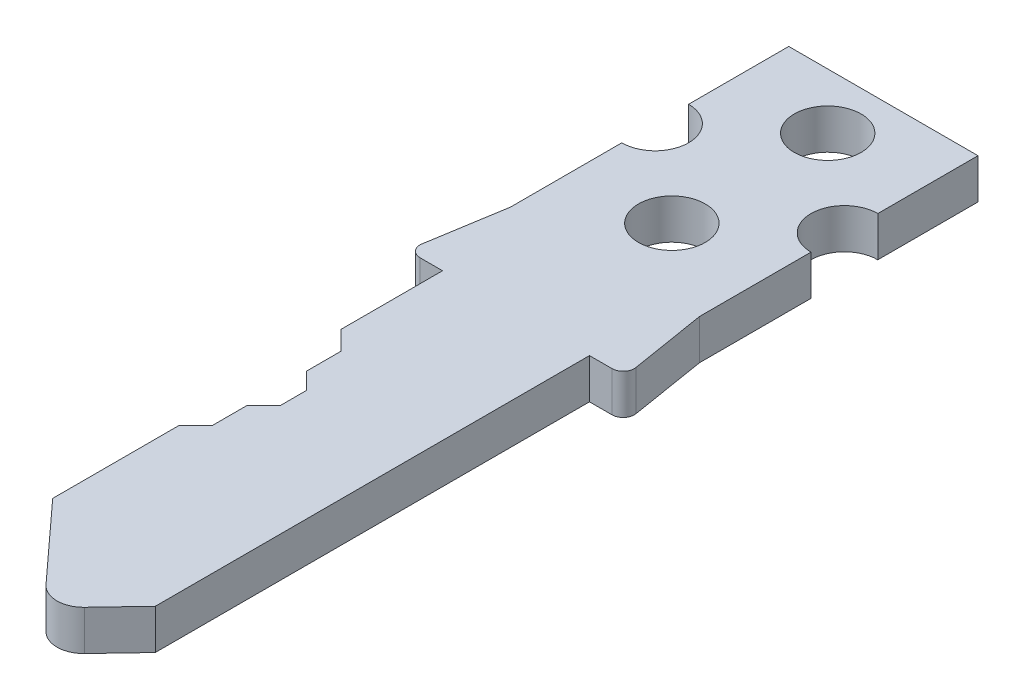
ISO-10303-21;
HEADER;
FILE_DESCRIPTION(('STEP AP214'),'2;1');
FILE_NAME('part.step','',(''),(''),'','','');
FILE_SCHEMA(('AUTOMOTIVE_DESIGN { 1 0 10303 214 1 1 1 1 }'));
ENDSEC;
DATA;
#1=APPLICATION_CONTEXT('core data for automotive mechanical design processes');
#2=APPLICATION_PROTOCOL_DEFINITION('international standard','automotive_design',2000,#1);
#3=PRODUCT_CONTEXT('',#1,'mechanical');
#4=PRODUCT('Part','Part','',(#3));
#5=PRODUCT_RELATED_PRODUCT_CATEGORY('part','',(#4));
#6=PRODUCT_DEFINITION_FORMATION('','',#4);
#7=PRODUCT_DEFINITION_CONTEXT('part definition',#1,'design');
#8=PRODUCT_DEFINITION('design','',#6,#7);
#9=PRODUCT_DEFINITION_SHAPE('','',#8);
#10=(LENGTH_UNIT() NAMED_UNIT(*) SI_UNIT(.MILLI.,.METRE.));
#11=(NAMED_UNIT(*) PLANE_ANGLE_UNIT() SI_UNIT($,.RADIAN.));
#12=(NAMED_UNIT(*) SI_UNIT($,.STERADIAN.) SOLID_ANGLE_UNIT());
#13=UNCERTAINTY_MEASURE_WITH_UNIT(LENGTH_MEASURE(1.E-05),#10,'distance_accuracy_value','');
#14=(GEOMETRIC_REPRESENTATION_CONTEXT(3) GLOBAL_UNCERTAINTY_ASSIGNED_CONTEXT((#13)) GLOBAL_UNIT_ASSIGNED_CONTEXT((#10,
#11,#12)) REPRESENTATION_CONTEXT('',''));
#15=CARTESIAN_POINT('',(0.,0.,0.));
#16=DIRECTION('',(0.,0.,1.));
#17=DIRECTION('',(1.,0.,0.));
#18=AXIS2_PLACEMENT_3D('',#15,#16,#17);
#19=CARTESIAN_POINT('',(-1.7,1.8,8.9));
#20=DIRECTION('',(1.,0.,0.));
#21=DIRECTION('',(0.,0.,-1.));
#22=AXIS2_PLACEMENT_3D('',#19,#20,#21);
#23=PLANE('',#22);
#24=DIRECTION('',(0.,1.,0.));
#25=VECTOR('',#24,1.);
#26=CARTESIAN_POINT('',(-1.7,1.8,8.9));
#27=LINE('',#26,#25);
#28=CARTESIAN_POINT('',(-1.7,0.,8.9));
#29=VERTEX_POINT('',#28);
#30=CARTESIAN_POINT('',(-1.7,1.8,8.9));
#31=VERTEX_POINT('',#30);
#32=EDGE_CURVE('E218',#29,#31,#27,.T.);
#33=ORIENTED_EDGE('',*,*,#32,.T.);
#34=DIRECTION('',(0.,0.,-1.));
#35=VECTOR('',#34,1.);
#36=CARTESIAN_POINT('',(-1.7,1.8,8.9));
#37=LINE('',#36,#35);
#38=CARTESIAN_POINT('',(-1.7,1.8,7.7));
#39=VERTEX_POINT('',#38);
#40=EDGE_CURVE('E199',#39,#31,#37,.F.);
#41=ORIENTED_EDGE('',*,*,#40,.F.);
#42=DIRECTION('',(0.,1.,0.));
#43=VECTOR('',#42,1.);
#44=CARTESIAN_POINT('',(-1.7,1.8,7.7));
#45=LINE('',#44,#43);
#46=CARTESIAN_POINT('',(-1.7,0.,7.7));
#47=VERTEX_POINT('',#46);
#48=EDGE_CURVE('E231',#39,#47,#45,.F.);
#49=ORIENTED_EDGE('',*,*,#48,.T.);
#50=DIRECTION('',(0.,0.,-1.));
#51=VECTOR('',#50,1.);
#52=CARTESIAN_POINT('',(-1.7,0.,8.9));
#53=LINE('',#52,#51);
#54=EDGE_CURVE('E212',#29,#47,#53,.T.);
#55=ORIENTED_EDGE('',*,*,#54,.F.);
#56=EDGE_LOOP('',(#33,#41,#49,#55));
#57=FACE_BOUND('',#56,.T.);
#58=ADVANCED_FACE('F16',(#57),#23,.F.);
#59=CARTESIAN_POINT('',(-1.7,1.8,7.7));
#60=DIRECTION('',(0.707106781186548,0.,-0.707106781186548));
#61=DIRECTION('',(-0.707106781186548,0.,-0.707106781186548));
#62=AXIS2_PLACEMENT_3D('',#59,#60,#61);
#63=PLANE('',#62);
#64=ORIENTED_EDGE('',*,*,#48,.F.);
#65=DIRECTION('',(-0.707106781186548,0.,-0.707106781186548));
#66=VECTOR('',#65,1.);
#67=CARTESIAN_POINT('',(-1.7,1.8,7.7));
#68=LINE('',#67,#66);
#69=CARTESIAN_POINT('',(-2.45,1.8,6.95));
#70=VERTEX_POINT('',#69);
#71=EDGE_CURVE('E206',#70,#39,#68,.F.);
#72=ORIENTED_EDGE('',*,*,#71,.F.);
#73=DIRECTION('',(0.,1.,0.));
#74=VECTOR('',#73,1.);
#75=CARTESIAN_POINT('',(-2.45,1.8,6.95));
#76=LINE('',#75,#74);
#77=CARTESIAN_POINT('',(-2.45,0.,6.95));
#78=VERTEX_POINT('',#77);
#79=EDGE_CURVE('E375',#70,#78,#76,.F.);
#80=ORIENTED_EDGE('',*,*,#79,.T.);
#81=DIRECTION('',(-0.707106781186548,0.,-0.707106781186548));
#82=VECTOR('',#81,1.);
#83=CARTESIAN_POINT('',(-1.7,0.,7.7));
#84=LINE('',#83,#82);
#85=EDGE_CURVE('E226',#47,#78,#84,.T.);
#86=ORIENTED_EDGE('',*,*,#85,.F.);
#87=EDGE_LOOP('',(#64,#72,#80,#86));
#88=FACE_BOUND('',#87,.T.);
#89=ADVANCED_FACE('F880',(#88),#63,.F.);
#90=CARTESIAN_POINT('',(-2.45,1.8,9.65));
#91=DIRECTION('',(0.707106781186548,0.,0.707106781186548));
#92=DIRECTION('',(0.707106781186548,0.,-0.707106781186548));
#93=AXIS2_PLACEMENT_3D('',#90,#91,#92);
#94=PLANE('',#93);
#95=DIRECTION('',(0.,1.,0.));
#96=VECTOR('',#95,1.);
#97=CARTESIAN_POINT('',(-2.45,1.8,9.65));
#98=LINE('',#97,#96);
#99=CARTESIAN_POINT('',(-2.45,0.,9.65));
#100=VERTEX_POINT('',#99);
#101=CARTESIAN_POINT('',(-2.45,1.8,9.65));
#102=VERTEX_POINT('',#101);
#103=EDGE_CURVE('E221',#100,#102,#98,.T.);
#104=ORIENTED_EDGE('',*,*,#103,.T.);
#105=DIRECTION('',(0.707106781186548,0.,-0.707106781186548));
#106=VECTOR('',#105,1.);
#107=CARTESIAN_POINT('',(-2.45,1.8,9.65));
#108=LINE('',#107,#106);
#109=EDGE_CURVE('E203',#31,#102,#108,.F.);
#110=ORIENTED_EDGE('',*,*,#109,.F.);
#111=ORIENTED_EDGE('',*,*,#32,.F.);
#112=DIRECTION('',(0.707106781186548,0.,-0.707106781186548));
#113=VECTOR('',#112,1.);
#114=CARTESIAN_POINT('',(-2.45,0.,9.65));
#115=LINE('',#114,#113);
#116=EDGE_CURVE('E223',#100,#29,#115,.T.);
#117=ORIENTED_EDGE('',*,*,#116,.F.);
#118=EDGE_LOOP('',(#104,#110,#111,#117));
#119=FACE_BOUND('',#118,.T.);
#120=ADVANCED_FACE('F217',(#119),#94,.F.);
#121=CARTESIAN_POINT('',(-2.45,1.8,6.95));
#122=DIRECTION('',(1.,0.,0.));
#123=DIRECTION('',(0.,0.,-1.));
#124=AXIS2_PLACEMENT_3D('',#121,#122,#123);
#125=PLANE('',#124);
#126=ORIENTED_EDGE('',*,*,#79,.F.);
#127=DIRECTION('',(0.,0.,-1.));
#128=VECTOR('',#127,1.);
#129=CARTESIAN_POINT('',(-2.45,1.8,6.95));
#130=LINE('',#129,#128);
#131=CARTESIAN_POINT('',(-2.45,1.8,5.4));
#132=VERTEX_POINT('',#131);
#133=EDGE_CURVE('E379',#132,#70,#130,.F.);
#134=ORIENTED_EDGE('',*,*,#133,.F.);
#135=DIRECTION('',(0.,1.,0.));
#136=VECTOR('',#135,1.);
#137=CARTESIAN_POINT('',(-2.45,1.8,5.4));
#138=LINE('',#137,#136);
#139=CARTESIAN_POINT('',(-2.45,0.,5.4));
#140=VERTEX_POINT('',#139);
#141=EDGE_CURVE('E519',#132,#140,#138,.F.);
#142=ORIENTED_EDGE('',*,*,#141,.T.);
#143=DIRECTION('',(0.,0.,-1.));
#144=VECTOR('',#143,1.);
#145=CARTESIAN_POINT('',(-2.45,0.,6.95));
#146=LINE('',#145,#144);
#147=EDGE_CURVE('E371',#78,#140,#146,.T.);
#148=ORIENTED_EDGE('',*,*,#147,.F.);
#149=EDGE_LOOP('',(#126,#134,#142,#148));
#150=FACE_BOUND('',#149,.T.);
#151=ADVANCED_FACE('F862',(#150),#125,.F.);
#152=CARTESIAN_POINT('',(-2.45,1.8,11.2));
#153=DIRECTION('',(1.,0.,0.));
#154=DIRECTION('',(0.,0.,-1.));
#155=AXIS2_PLACEMENT_3D('',#152,#153,#154);
#156=PLANE('',#155);
#157=DIRECTION('',(0.,1.,0.));
#158=VECTOR('',#157,1.);
#159=CARTESIAN_POINT('',(-2.45000000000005,1.8,11.1999999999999));
#160=LINE('',#159,#158);
#161=CARTESIAN_POINT('',(-2.45000000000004,0.,11.2));
#162=VERTEX_POINT('',#161);
#163=CARTESIAN_POINT('',(-2.45000000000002,1.8,11.2));
#164=VERTEX_POINT('',#163);
#165=EDGE_CURVE('E323',#162,#164,#160,.T.);
#166=ORIENTED_EDGE('',*,*,#165,.T.);
#167=DIRECTION('',(0.,0.,-1.));
#168=VECTOR('',#167,1.);
#169=CARTESIAN_POINT('',(-2.45,1.8,11.2));
#170=LINE('',#169,#168);
#171=EDGE_CURVE('E353',#102,#164,#170,.F.);
#172=ORIENTED_EDGE('',*,*,#171,.F.);
#173=ORIENTED_EDGE('',*,*,#103,.F.);
#174=DIRECTION('',(0.,0.,-1.));
#175=VECTOR('',#174,1.);
#176=CARTESIAN_POINT('',(-2.45,0.,11.2));
#177=LINE('',#176,#175);
#178=EDGE_CURVE('E349',#162,#100,#177,.T.);
#179=ORIENTED_EDGE('',*,*,#178,.F.);
#180=EDGE_LOOP('',(#166,#172,#173,#179));
#181=FACE_BOUND('',#180,.T.);
#182=ADVANCED_FACE('F394',(#181),#156,.F.);
#183=CARTESIAN_POINT('',(-4.312191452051,1.86754608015,-0.5));
#184=DIRECTION('',(0.,-1.,0.));
#185=DIRECTION('',(0.,0.,-1.));
#186=AXIS2_PLACEMENT_3D('',#183,#184,#185);
#187=CYLINDRICAL_SURFACE('',#186,0.5);
#188=DIRECTION('',(0.,1.,0.));
#189=VECTOR('',#188,1.);
#190=CARTESIAN_POINT('',(-4.80571781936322,0.,-0.580198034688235));
#191=LINE('',#190,#189);
#192=CARTESIAN_POINT('',(-4.80571781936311,0.,-0.580198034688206));
#193=VERTEX_POINT('',#192);
#194=CARTESIAN_POINT('',(-4.80571781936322,1.8,-0.580198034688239));
#195=VERTEX_POINT('',#194);
#196=EDGE_CURVE('E432',#193,#195,#191,.T.);
#197=ORIENTED_EDGE('',*,*,#196,.F.);
#198=CARTESIAN_POINT('',(-4.312191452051,0.,-0.5));
#199=DIRECTION('',(0.,-1.,0.));
#200=DIRECTION('',(0.,0.,-1.));
#201=AXIS2_PLACEMENT_3D('',#198,#199,#200);
#202=CIRCLE('',#201,0.5);
#203=CARTESIAN_POINT('',(-4.312191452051,0.,0.));
#204=VERTEX_POINT('',#203);
#205=EDGE_CURVE('E19',#193,#204,#202,.F.);
#206=ORIENTED_EDGE('',*,*,#205,.T.);
#207=DIRECTION('',(0.,1.,0.));
#208=VECTOR('',#207,1.);
#209=CARTESIAN_POINT('',(-4.312191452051,0.,0.));
#210=LINE('',#209,#208);
#211=CARTESIAN_POINT('',(-4.312191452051,1.8,0.));
#212=VERTEX_POINT('',#211);
#213=EDGE_CURVE('E330',#212,#204,#210,.F.);
#214=ORIENTED_EDGE('',*,*,#213,.F.);
#215=CARTESIAN_POINT('',(-4.312191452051,1.8,-0.5));
#216=DIRECTION('',(0.,-1.,0.));
#217=DIRECTION('',(0.,0.,-1.));
#218=AXIS2_PLACEMENT_3D('',#215,#216,#217);
#219=CIRCLE('',#218,0.5);
#220=EDGE_CURVE('E299',#195,#212,#219,.F.);
#221=ORIENTED_EDGE('',*,*,#220,.F.);
#222=EDGE_LOOP('',(#197,#206,#214,#221));
#223=FACE_BOUND('',#222,.T.);
#224=ADVANCED_FACE('F843',(#223),#187,.T.);
#225=CARTESIAN_POINT('',(-2.45,1.8,5.4));
#226=DIRECTION('',(0.707106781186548,0.,-0.707106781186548));
#227=DIRECTION('',(-0.707106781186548,0.,-0.707106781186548));
#228=AXIS2_PLACEMENT_3D('',#225,#226,#227);
#229=PLANE('',#228);
#230=ORIENTED_EDGE('',*,*,#141,.F.);
#231=DIRECTION('',(0.707106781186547,0.,0.707106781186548));
#232=VECTOR('',#231,1.);
#233=CARTESIAN_POINT('',(-3.3,1.8,4.55));
#234=LINE('',#233,#232);
#235=CARTESIAN_POINT('',(-3.3,1.8,4.55));
#236=VERTEX_POINT('',#235);
#237=EDGE_CURVE('E406',#236,#132,#234,.T.);
#238=ORIENTED_EDGE('',*,*,#237,.F.);
#239=DIRECTION('',(0.,1.,0.));
#240=VECTOR('',#239,1.);
#241=CARTESIAN_POINT('',(-3.3,0.,4.55));
#242=LINE('',#241,#240);
#243=CARTESIAN_POINT('',(-3.3,0.,4.55));
#244=VERTEX_POINT('',#243);
#245=EDGE_CURVE('E340',#244,#236,#242,.T.);
#246=ORIENTED_EDGE('',*,*,#245,.F.);
#247=DIRECTION('',(-0.707106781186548,0.,-0.707106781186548));
#248=VECTOR('',#247,1.);
#249=CARTESIAN_POINT('',(-2.45,0.,5.4));
#250=LINE('',#249,#248);
#251=EDGE_CURVE('E334',#140,#244,#250,.T.);
#252=ORIENTED_EDGE('',*,*,#251,.F.);
#253=EDGE_LOOP('',(#230,#238,#246,#252));
#254=FACE_BOUND('',#253,.T.);
#255=ADVANCED_FACE('F833',(#254),#229,.F.);
#256=CARTESIAN_POINT('',(-4.9,0.,0.));
#257=DIRECTION('',(0.,0.,1.));
#258=DIRECTION('',(1.,0.,0.));
#259=AXIS2_PLACEMENT_3D('',#256,#257,#258);
#260=PLANE('',#259);
#261=DIRECTION('',(0.,1.,0.));
#262=VECTOR('',#261,1.);
#263=CARTESIAN_POINT('',(-3.3,0.,0.));
#264=LINE('',#263,#262);
#265=CARTESIAN_POINT('',(-3.3,1.8,0.));
#266=VERTEX_POINT('',#265);
#267=CARTESIAN_POINT('',(-3.3,0.,0.));
#268=VERTEX_POINT('',#267);
#269=EDGE_CURVE('E339',#266,#268,#264,.F.);
#270=ORIENTED_EDGE('',*,*,#269,.F.);
#271=DIRECTION('',(1.,0.,0.));
#272=VECTOR('',#271,1.);
#273=CARTESIAN_POINT('',(0.,1.8,0.));
#274=LINE('',#273,#272);
#275=EDGE_CURVE('E301',#212,#266,#274,.T.);
#276=ORIENTED_EDGE('',*,*,#275,.F.);
#277=ORIENTED_EDGE('',*,*,#213,.T.);
#278=DIRECTION('',(1.,0.,0.));
#279=VECTOR('',#278,1.);
#280=CARTESIAN_POINT('',(-4.9,0.,0.));
#281=LINE('',#280,#279);
#282=EDGE_CURVE('E327',#204,#268,#281,.T.);
#283=ORIENTED_EDGE('',*,*,#282,.T.);
#284=EDGE_LOOP('',(#270,#276,#277,#283));
#285=FACE_BOUND('',#284,.T.);
#286=ADVANCED_FACE('F824',(#285),#260,.T.);
#287=CARTESIAN_POINT('',(-3.2,1.8,11.95));
#288=DIRECTION('',(0.707106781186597,0.,0.707106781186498));
#289=DIRECTION('',(0.707106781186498,0.,-0.707106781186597));
#290=AXIS2_PLACEMENT_3D('',#287,#288,#289);
#291=PLANE('',#290);
#292=DIRECTION('',(0.,1.,0.));
#293=VECTOR('',#292,1.);
#294=CARTESIAN_POINT('',(-3.2,1.8,11.95));
#295=LINE('',#294,#293);
#296=CARTESIAN_POINT('',(-3.2,0.,11.95));
#297=VERTEX_POINT('',#296);
#298=CARTESIAN_POINT('',(-3.2,1.8,11.95));
#299=VERTEX_POINT('',#298);
#300=EDGE_CURVE('E346',#297,#299,#295,.T.);
#301=ORIENTED_EDGE('',*,*,#300,.T.);
#302=DIRECTION('',(-0.707106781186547,0.,0.707106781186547));
#303=VECTOR('',#302,1.);
#304=CARTESIAN_POINT('',(-2.45,1.8,11.2));
#305=LINE('',#304,#303);
#306=EDGE_CURVE('E398',#164,#299,#305,.T.);
#307=ORIENTED_EDGE('',*,*,#306,.F.);
#308=ORIENTED_EDGE('',*,*,#165,.F.);
#309=DIRECTION('',(0.707106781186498,0.,-0.707106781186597));
#310=VECTOR('',#309,1.);
#311=CARTESIAN_POINT('',(-3.2,0.,11.95));
#312=LINE('',#311,#310);
#313=EDGE_CURVE('E317',#297,#162,#312,.T.);
#314=ORIENTED_EDGE('',*,*,#313,.F.);
#315=EDGE_LOOP('',(#301,#307,#308,#314));
#316=FACE_BOUND('',#315,.T.);
#317=ADVANCED_FACE('F418',(#316),#291,.F.);
#318=CARTESIAN_POINT('',(3.3,0.,0.));
#319=DIRECTION('',(0.,0.,1.));
#320=DIRECTION('',(1.,0.,0.));
#321=AXIS2_PLACEMENT_3D('',#318,#319,#320);
#322=PLANE('',#321);
#323=DIRECTION('',(0.,1.,0.));
#324=VECTOR('',#323,1.);
#325=CARTESIAN_POINT('',(3.3,0.,0.));
#326=LINE('',#325,#324);
#327=CARTESIAN_POINT('',(3.3,0.,0.));
#328=VERTEX_POINT('',#327);
#329=CARTESIAN_POINT('',(3.3,1.8,0.));
#330=VERTEX_POINT('',#329);
#331=EDGE_CURVE('E497',#328,#330,#326,.T.);
#332=ORIENTED_EDGE('',*,*,#331,.F.);
#333=DIRECTION('',(1.,0.,0.));
#334=VECTOR('',#333,1.);
#335=CARTESIAN_POINT('',(3.3,0.,0.));
#336=LINE('',#335,#334);
#337=CARTESIAN_POINT('',(4.312191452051,0.,0.));
#338=VERTEX_POINT('',#337);
#339=EDGE_CURVE('E313',#328,#338,#336,.T.);
#340=ORIENTED_EDGE('',*,*,#339,.T.);
#341=DIRECTION('',(0.,-1.,0.));
#342=VECTOR('',#341,1.);
#343=CARTESIAN_POINT('',(4.312191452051,1.86754608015,0.));
#344=LINE('',#343,#342);
#345=CARTESIAN_POINT('',(4.312191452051,1.8,0.));
#346=VERTEX_POINT('',#345);
#347=EDGE_CURVE('E304',#346,#338,#344,.T.);
#348=ORIENTED_EDGE('',*,*,#347,.F.);
#349=DIRECTION('',(1.,0.,0.));
#350=VECTOR('',#349,1.);
#351=CARTESIAN_POINT('',(0.,1.8,0.));
#352=LINE('',#351,#350);
#353=EDGE_CURVE('E298',#330,#346,#352,.T.);
#354=ORIENTED_EDGE('',*,*,#353,.F.);
#355=EDGE_LOOP('',(#332,#340,#348,#354));
#356=FACE_BOUND('',#355,.T.);
#357=ADVANCED_FACE('F653',(#356),#322,.T.);
#358=CARTESIAN_POINT('',(4.312191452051,1.86754608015,-0.5));
#359=DIRECTION('',(0.,-1.,0.));
#360=DIRECTION('',(0.,0.,-1.));
#361=AXIS2_PLACEMENT_3D('',#358,#359,#360);
#362=CYLINDRICAL_SURFACE('',#361,0.5);
#363=ORIENTED_EDGE('',*,*,#347,.T.);
#364=CARTESIAN_POINT('',(4.312191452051,0.,-0.5));
#365=DIRECTION('',(0.,-1.,0.));
#366=DIRECTION('',(0.,0.,-1.));
#367=AXIS2_PLACEMENT_3D('',#364,#365,#366);
#368=CIRCLE('',#367,0.5);
#369=CARTESIAN_POINT('',(4.80571781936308,0.,-0.580198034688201));
#370=VERTEX_POINT('',#369);
#371=EDGE_CURVE('E302',#338,#370,#368,.F.);
#372=ORIENTED_EDGE('',*,*,#371,.T.);
#373=DIRECTION('',(0.,1.,0.));
#374=VECTOR('',#373,1.);
#375=CARTESIAN_POINT('',(4.80571781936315,0.,-0.580198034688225));
#376=LINE('',#375,#374);
#377=CARTESIAN_POINT('',(4.80571781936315,1.8,-0.580198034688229));
#378=VERTEX_POINT('',#377);
#379=EDGE_CURVE('E484',#378,#370,#376,.F.);
#380=ORIENTED_EDGE('',*,*,#379,.F.);
#381=CARTESIAN_POINT('',(4.312191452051,1.8,-0.5));
#382=DIRECTION('',(0.,-1.,0.));
#383=DIRECTION('',(0.,0.,-1.));
#384=AXIS2_PLACEMENT_3D('',#381,#382,#383);
#385=CIRCLE('',#384,0.5);
#386=EDGE_CURVE('E294',#346,#378,#385,.F.);
#387=ORIENTED_EDGE('',*,*,#386,.F.);
#388=EDGE_LOOP('',(#363,#372,#380,#387));
#389=FACE_BOUND('',#388,.T.);
#390=ADVANCED_FACE('F658',(#389),#362,.T.);
#391=CARTESIAN_POINT('',(0.,1.8,0.));
#392=DIRECTION('',(0.,1.,0.));
#393=DIRECTION('',(0.,0.,1.));
#394=AXIS2_PLACEMENT_3D('',#391,#392,#393);
#395=PLANE('',#394);
#396=CARTESIAN_POINT('',(0.,1.8,-7.));
#397=DIRECTION('',(0.,1.,0.));
#398=DIRECTION('',(0.,0.,1.));
#399=AXIS2_PLACEMENT_3D('',#396,#397,#398);
#400=CIRCLE('',#399,1.5);
#401=CARTESIAN_POINT('',(0.,1.8,-5.5));
#402=VERTEX_POINT('',#401);
#403=EDGE_CURVE('E272',#402,#402,#400,.F.);
#404=ORIENTED_EDGE('',*,*,#403,.T.);
#405=EDGE_LOOP('',(#404));
#406=FACE_BOUND('',#405,.T.);
#407=CARTESIAN_POINT('',(0.,1.8,-14.));
#408=DIRECTION('',(0.,1.,0.));
#409=DIRECTION('',(0.,0.,1.));
#410=AXIS2_PLACEMENT_3D('',#407,#408,#409);
#411=CIRCLE('',#410,1.5);
#412=CARTESIAN_POINT('',(0.,1.8,-12.5));
#413=VERTEX_POINT('',#412);
#414=EDGE_CURVE('E277',#413,#413,#411,.F.);
#415=ORIENTED_EDGE('',*,*,#414,.T.);
#416=EDGE_LOOP('',(#415));
#417=FACE_BOUND('',#416,.T.);
#418=DIRECTION('',(-1.,0.,0.));
#419=VECTOR('',#418,1.);
#420=CARTESIAN_POINT('',(4.25,1.8,-16.5));
#421=LINE('',#420,#419);
#422=CARTESIAN_POINT('',(-4.25,1.8,-16.5));
#423=VERTEX_POINT('',#422);
#424=CARTESIAN_POINT('',(4.25,1.8,-16.5));
#425=VERTEX_POINT('',#424);
#426=EDGE_CURVE('E461',#423,#425,#421,.F.);
#427=ORIENTED_EDGE('',*,*,#426,.F.);
#428=DIRECTION('',(0.,0.,1.));
#429=VECTOR('',#428,1.);
#430=CARTESIAN_POINT('',(-4.25,1.8,-16.5));
#431=LINE('',#430,#429);
#432=CARTESIAN_POINT('',(-4.25,1.8,-12.));
#433=VERTEX_POINT('',#432);
#434=EDGE_CURVE('E454',#433,#423,#431,.F.);
#435=ORIENTED_EDGE('',*,*,#434,.F.);
#436=CARTESIAN_POINT('',(-4.25,1.8,-10.5));
#437=DIRECTION('',(0.,1.,0.));
#438=DIRECTION('',(0.,0.,1.));
#439=AXIS2_PLACEMENT_3D('',#436,#437,#438);
#440=CIRCLE('',#439,1.5);
#441=CARTESIAN_POINT('',(-4.25,1.8,-9.));
#442=VERTEX_POINT('',#441);
#443=EDGE_CURVE('E282',#433,#442,#440,.F.);
#444=ORIENTED_EDGE('',*,*,#443,.T.);
#445=DIRECTION('',(0.,0.,1.));
#446=VECTOR('',#445,1.);
#447=CARTESIAN_POINT('',(-4.25,1.8,-16.5));
#448=LINE('',#447,#446);
#449=CARTESIAN_POINT('',(-4.25,1.8,-4.));
#450=VERTEX_POINT('',#449);
#451=EDGE_CURVE('E297',#450,#442,#448,.F.);
#452=ORIENTED_EDGE('',*,*,#451,.F.);
#453=DIRECTION('',(-0.160396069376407,0.,0.98705273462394));
#454=VECTOR('',#453,1.);
#455=CARTESIAN_POINT('',(-4.25,1.8,-4.));
#456=LINE('',#455,#454);
#457=EDGE_CURVE('E434',#195,#450,#456,.F.);
#458=ORIENTED_EDGE('',*,*,#457,.F.);
#459=ORIENTED_EDGE('',*,*,#220,.T.);
#460=ORIENTED_EDGE('',*,*,#275,.T.);
#461=DIRECTION('',(0.,0.,1.));
#462=VECTOR('',#461,1.);
#463=CARTESIAN_POINT('',(-3.3,1.8,0.));
#464=LINE('',#463,#462);
#465=EDGE_CURVE('E335',#236,#266,#464,.F.);
#466=ORIENTED_EDGE('',*,*,#465,.F.);
#467=ORIENTED_EDGE('',*,*,#237,.T.);
#468=ORIENTED_EDGE('',*,*,#133,.T.);
#469=ORIENTED_EDGE('',*,*,#71,.T.);
#470=ORIENTED_EDGE('',*,*,#40,.T.);
#471=ORIENTED_EDGE('',*,*,#109,.T.);
#472=ORIENTED_EDGE('',*,*,#171,.T.);
#473=ORIENTED_EDGE('',*,*,#306,.T.);
#474=DIRECTION('',(0.,0.,-1.));
#475=VECTOR('',#474,1.);
#476=CARTESIAN_POINT('',(-3.2,1.8,17.60938439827));
#477=LINE('',#476,#475);
#478=CARTESIAN_POINT('',(-3.1999999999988,1.8,17.6093843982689));
#479=VERTEX_POINT('',#478);
#480=EDGE_CURVE('E401',#299,#479,#477,.F.);
#481=ORIENTED_EDGE('',*,*,#480,.T.);
#482=DIRECTION('',(0.674737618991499,0.,0.738057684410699));
#483=VECTOR('',#482,1.);
#484=CARTESIAN_POINT('',(-3.3,1.8,17.5));
#485=LINE('',#484,#483);
#486=CARTESIAN_POINT('',(0.,1.8,21.10968514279));
#487=VERTEX_POINT('',#486);
#488=EDGE_CURVE('E293',#487,#479,#485,.F.);
#489=ORIENTED_EDGE('',*,*,#488,.F.);
#490=CARTESIAN_POINT('',(0.8856692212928,1.8,20.3));
#491=DIRECTION('',(0.,1.,0.));
#492=DIRECTION('',(0.,0.,1.));
#493=AXIS2_PLACEMENT_3D('',#490,#491,#492);
#494=CIRCLE('',#493,1.2);
#495=CARTESIAN_POINT('',(1.75589372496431,1.8,21.1262622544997));
#496=VERTEX_POINT('',#495);
#497=EDGE_CURVE('E290',#496,#487,#494,.F.);
#498=ORIENTED_EDGE('',*,*,#497,.F.);
#499=DIRECTION('',(0.688551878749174,0.,-0.725187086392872));
#500=VECTOR('',#499,1.);
#501=CARTESIAN_POINT('',(1.755893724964,1.8,21.1262622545));
#502=LINE('',#501,#500);
#503=CARTESIAN_POINT('',(3.30000000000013,1.8,19.5000000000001));
#504=VERTEX_POINT('',#503);
#505=EDGE_CURVE('E487',#504,#496,#502,.F.);
#506=ORIENTED_EDGE('',*,*,#505,.F.);
#507=DIRECTION('',(0.,0.,-1.));
#508=VECTOR('',#507,1.);
#509=CARTESIAN_POINT('',(3.3,1.8,19.5));
#510=LINE('',#509,#508);
#511=EDGE_CURVE('E492',#330,#504,#510,.F.);
#512=ORIENTED_EDGE('',*,*,#511,.F.);
#513=ORIENTED_EDGE('',*,*,#353,.T.);
#514=ORIENTED_EDGE('',*,*,#386,.T.);
#515=DIRECTION('',(-0.160396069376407,0.,-0.98705273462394));
#516=VECTOR('',#515,1.);
#517=CARTESIAN_POINT('',(4.9,1.8,0.));
#518=LINE('',#517,#516);
#519=CARTESIAN_POINT('',(4.24999999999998,1.8,-4.));
#520=VERTEX_POINT('',#519);
#521=EDGE_CURVE('E478',#520,#378,#518,.F.);
#522=ORIENTED_EDGE('',*,*,#521,.F.);
#523=DIRECTION('',(0.,0.,-1.));
#524=VECTOR('',#523,1.);
#525=CARTESIAN_POINT('',(4.25,1.8,-4.));
#526=LINE('',#525,#524);
#527=CARTESIAN_POINT('',(4.25,1.8,-9.));
#528=VERTEX_POINT('',#527);
#529=EDGE_CURVE('E473',#528,#520,#526,.F.);
#530=ORIENTED_EDGE('',*,*,#529,.F.);
#531=CARTESIAN_POINT('',(4.25,1.8,-10.5));
#532=DIRECTION('',(0.,1.,0.));
#533=DIRECTION('',(0.,0.,1.));
#534=AXIS2_PLACEMENT_3D('',#531,#532,#533);
#535=CIRCLE('',#534,1.5);
#536=CARTESIAN_POINT('',(4.25,1.8,-12.));
#537=VERTEX_POINT('',#536);
#538=EDGE_CURVE('E285',#528,#537,#535,.F.);
#539=ORIENTED_EDGE('',*,*,#538,.T.);
#540=DIRECTION('',(0.,0.,-1.));
#541=VECTOR('',#540,1.);
#542=CARTESIAN_POINT('',(4.25,1.8,-4.));
#543=LINE('',#542,#541);
#544=EDGE_CURVE('E465',#425,#537,#543,.F.);
#545=ORIENTED_EDGE('',*,*,#544,.F.);
#546=EDGE_LOOP('',(#427,#435,#444,#452,#458,#459,#460,#466,#467,#468,#469,#470,#471,#472,#473,
#481,#489,#498,#506,#512,#513,#514,#522,#530,#539,#545));
#547=FACE_BOUND('',#546,.T.);
#548=ADVANCED_FACE('F202',(#406,#417,#547),#395,.T.);
#549=CARTESIAN_POINT('',(-4.25,0.,-16.5));
#550=DIRECTION('',(-1.,0.,0.));
#551=DIRECTION('',(0.,0.,1.));
#552=AXIS2_PLACEMENT_3D('',#549,#550,#551);
#553=PLANE('',#552);
#554=DIRECTION('',(0.,1.,0.));
#555=VECTOR('',#554,1.);
#556=CARTESIAN_POINT('',(-4.25,0.,-4.));
#557=LINE('',#556,#555);
#558=CARTESIAN_POINT('',(-4.25,0.,-4.00000000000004));
#559=VERTEX_POINT('',#558);
#560=EDGE_CURVE('E138',#450,#559,#557,.F.);
#561=ORIENTED_EDGE('',*,*,#560,.F.);
#562=ORIENTED_EDGE('',*,*,#451,.T.);
#563=DIRECTION('',(0.,1.,0.));
#564=VECTOR('',#563,1.);
#565=CARTESIAN_POINT('',(-4.25,1.8,-9.));
#566=LINE('',#565,#564);
#567=CARTESIAN_POINT('',(-4.25,0.,-9.));
#568=VERTEX_POINT('',#567);
#569=EDGE_CURVE('E281',#442,#568,#566,.F.);
#570=ORIENTED_EDGE('',*,*,#569,.T.);
#571=DIRECTION('',(0.,0.,1.));
#572=VECTOR('',#571,1.);
#573=CARTESIAN_POINT('',(-4.25,0.,0.));
#574=LINE('',#573,#572);
#575=EDGE_CURVE('E276',#568,#559,#574,.T.);
#576=ORIENTED_EDGE('',*,*,#575,.T.);
#577=EDGE_LOOP('',(#561,#562,#570,#576));
#578=FACE_BOUND('',#577,.T.);
#579=ADVANCED_FACE('F530',(#578),#553,.T.);
#580=CARTESIAN_POINT('',(-4.25,0.,-4.));
#581=DIRECTION('',(-0.98705273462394,0.,-0.160396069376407));
#582=DIRECTION('',(-0.160396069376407,0.,0.98705273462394));
#583=AXIS2_PLACEMENT_3D('',#580,#581,#582);
#584=PLANE('',#583);
#585=ORIENTED_EDGE('',*,*,#560,.T.);
#586=DIRECTION('',(-0.160396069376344,0.,0.98705273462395));
#587=VECTOR('',#586,1.);
#588=CARTESIAN_POINT('',(-4.25,0.,-4.));
#589=LINE('',#588,#587);
#590=EDGE_CURVE('E368',#559,#193,#589,.T.);
#591=ORIENTED_EDGE('',*,*,#590,.T.);
#592=ORIENTED_EDGE('',*,*,#196,.T.);
#593=ORIENTED_EDGE('',*,*,#457,.T.);
#594=EDGE_LOOP('',(#585,#591,#592,#593));
#595=FACE_BOUND('',#594,.T.);
#596=ADVANCED_FACE('F524',(#595),#584,.T.);
#597=CARTESIAN_POINT('',(-3.3,0.,0.));
#598=DIRECTION('',(-1.,0.,0.));
#599=DIRECTION('',(0.,0.,1.));
#600=AXIS2_PLACEMENT_3D('',#597,#598,#599);
#601=PLANE('',#600);
#602=ORIENTED_EDGE('',*,*,#269,.T.);
#603=DIRECTION('',(0.,0.,1.));
#604=VECTOR('',#603,1.);
#605=CARTESIAN_POINT('',(-3.3,0.,0.));
#606=LINE('',#605,#604);
#607=EDGE_CURVE('E363',#268,#244,#606,.T.);
#608=ORIENTED_EDGE('',*,*,#607,.T.);
#609=ORIENTED_EDGE('',*,*,#245,.T.);
#610=ORIENTED_EDGE('',*,*,#465,.T.);
#611=EDGE_LOOP('',(#602,#608,#609,#610));
#612=FACE_BOUND('',#611,.T.);
#613=ADVANCED_FACE('F714',(#612),#601,.T.);
#614=CARTESIAN_POINT('',(-3.2,1.8,17.60938439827));
#615=DIRECTION('',(1.,0.,0.));
#616=DIRECTION('',(0.,0.,-1.));
#617=AXIS2_PLACEMENT_3D('',#614,#615,#616);
#618=PLANE('',#617);
#619=DIRECTION('',(0.,1.,0.));
#620=VECTOR('',#619,1.);
#621=CARTESIAN_POINT('',(-3.19999999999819,0.,17.6093843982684));
#622=LINE('',#621,#620);
#623=CARTESIAN_POINT('',(-3.1999999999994,0.,17.6093843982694));
#624=VERTEX_POINT('',#623);
#625=EDGE_CURVE('E415',#479,#624,#622,.F.);
#626=ORIENTED_EDGE('',*,*,#625,.F.);
#627=ORIENTED_EDGE('',*,*,#480,.F.);
#628=ORIENTED_EDGE('',*,*,#300,.F.);
#629=DIRECTION('',(0.,0.,1.));
#630=VECTOR('',#629,1.);
#631=CARTESIAN_POINT('',(-3.2,0.,0.));
#632=LINE('',#631,#630);
#633=EDGE_CURVE('E367',#297,#624,#632,.T.);
#634=ORIENTED_EDGE('',*,*,#633,.T.);
#635=EDGE_LOOP('',(#626,#627,#628,#634));
#636=FACE_BOUND('',#635,.T.);
#637=ADVANCED_FACE('F411',(#636),#618,.F.);
#638=CARTESIAN_POINT('',(-3.3,0.,17.5));
#639=DIRECTION('',(-0.738057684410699,0.,0.674737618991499));
#640=DIRECTION('',(0.674737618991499,0.,0.738057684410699));
#641=AXIS2_PLACEMENT_3D('',#638,#639,#640);
#642=PLANE('',#641);
#643=DIRECTION('',(0.,1.,0.));
#644=VECTOR('',#643,1.);
#645=CARTESIAN_POINT('',(0.,0.,21.1096851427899));
#646=LINE('',#645,#644);
#647=CARTESIAN_POINT('',(2.06323673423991E-13,0.,21.1096851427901));
#648=VERTEX_POINT('',#647);
#649=EDGE_CURVE('E292',#487,#648,#646,.F.);
#650=ORIENTED_EDGE('',*,*,#649,.F.);
#651=ORIENTED_EDGE('',*,*,#488,.T.);
#652=ORIENTED_EDGE('',*,*,#625,.T.);
#653=DIRECTION('',(0.674737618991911,0.,0.738057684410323));
#654=VECTOR('',#653,1.);
#655=CARTESIAN_POINT('',(-3.2,0.,17.60938439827));
#656=LINE('',#655,#654);
#657=EDGE_CURVE('E271',#624,#648,#656,.T.);
#658=ORIENTED_EDGE('',*,*,#657,.T.);
#659=EDGE_LOOP('',(#650,#651,#652,#658));
#660=FACE_BOUND('',#659,.T.);
#661=ADVANCED_FACE('F634',(#660),#642,.T.);
#662=CARTESIAN_POINT('',(0.8856692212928,0.,20.3));
#663=DIRECTION('',(0.,1.,0.));
#664=DIRECTION('',(0.,0.,1.));
#665=AXIS2_PLACEMENT_3D('',#662,#663,#664);
#666=CYLINDRICAL_SURFACE('',#665,1.2);
#667=ORIENTED_EDGE('',*,*,#497,.T.);
#668=ORIENTED_EDGE('',*,*,#649,.T.);
#669=CARTESIAN_POINT('',(0.8856692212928,0.,20.3));
#670=DIRECTION('',(0.,1.,0.));
#671=DIRECTION('',(0.,0.,1.));
#672=AXIS2_PLACEMENT_3D('',#669,#670,#671);
#673=CIRCLE('',#672,1.2);
#674=CARTESIAN_POINT('',(1.75589372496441,0.,21.1262622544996));
#675=VERTEX_POINT('',#674);
#676=EDGE_CURVE('E267',#648,#675,#673,.T.);
#677=ORIENTED_EDGE('',*,*,#676,.T.);
#678=DIRECTION('',(0.,1.,0.));
#679=VECTOR('',#678,1.);
#680=CARTESIAN_POINT('',(1.755893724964,0.,21.1262622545));
#681=LINE('',#680,#679);
#682=EDGE_CURVE('E489',#496,#675,#681,.F.);
#683=ORIENTED_EDGE('',*,*,#682,.F.);
#684=EDGE_LOOP('',(#667,#668,#677,#683));
#685=FACE_BOUND('',#684,.T.);
#686=ADVANCED_FACE('F640',(#685),#666,.T.);
#687=CARTESIAN_POINT('',(1.755893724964,0.,21.1262622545));
#688=DIRECTION('',(0.725187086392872,0.,0.688551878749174));
#689=DIRECTION('',(0.688551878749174,0.,-0.725187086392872));
#690=AXIS2_PLACEMENT_3D('',#687,#688,#689);
#691=PLANE('',#690);
#692=ORIENTED_EDGE('',*,*,#505,.T.);
#693=ORIENTED_EDGE('',*,*,#682,.T.);
#694=DIRECTION('',(0.688551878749,0.,-0.725187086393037));
#695=VECTOR('',#694,1.);
#696=CARTESIAN_POINT('',(1.755893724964,0.,21.1262622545));
#697=LINE('',#696,#695);
#698=CARTESIAN_POINT('',(3.3,0.,19.5));
#699=VERTEX_POINT('',#698);
#700=EDGE_CURVE('E270',#675,#699,#697,.T.);
#701=ORIENTED_EDGE('',*,*,#700,.T.);
#702=DIRECTION('',(0.,1.,0.));
#703=VECTOR('',#702,1.);
#704=CARTESIAN_POINT('',(3.3,0.,19.5));
#705=LINE('',#704,#703);
#706=EDGE_CURVE('E496',#504,#699,#705,.F.);
#707=ORIENTED_EDGE('',*,*,#706,.F.);
#708=EDGE_LOOP('',(#692,#693,#701,#707));
#709=FACE_BOUND('',#708,.T.);
#710=ADVANCED_FACE('F646',(#709),#691,.T.);
#711=CARTESIAN_POINT('',(3.3,0.,19.5));
#712=DIRECTION('',(1.,0.,0.));
#713=DIRECTION('',(0.,0.,-1.));
#714=AXIS2_PLACEMENT_3D('',#711,#712,#713);
#715=PLANE('',#714);
#716=ORIENTED_EDGE('',*,*,#511,.T.);
#717=ORIENTED_EDGE('',*,*,#706,.T.);
#718=DIRECTION('',(0.,0.,1.));
#719=VECTOR('',#718,1.);
#720=CARTESIAN_POINT('',(3.3,0.,0.));
#721=LINE('',#720,#719);
#722=EDGE_CURVE('E568',#699,#328,#721,.F.);
#723=ORIENTED_EDGE('',*,*,#722,.T.);
#724=ORIENTED_EDGE('',*,*,#331,.T.);
#725=EDGE_LOOP('',(#716,#717,#723,#724));
#726=FACE_BOUND('',#725,.T.);
#727=ADVANCED_FACE('F648',(#726),#715,.T.);
#728=CARTESIAN_POINT('',(4.9,0.,0.));
#729=DIRECTION('',(0.98705273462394,0.,-0.160396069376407));
#730=DIRECTION('',(-0.160396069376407,0.,-0.98705273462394));
#731=AXIS2_PLACEMENT_3D('',#728,#729,#730);
#732=PLANE('',#731);
#733=DIRECTION('',(0.,1.,0.));
#734=VECTOR('',#733,1.);
#735=CARTESIAN_POINT('',(4.25,0.,-4.));
#736=LINE('',#735,#734);
#737=CARTESIAN_POINT('',(4.25,0.,-4.));
#738=VERTEX_POINT('',#737);
#739=EDGE_CURVE('E477',#520,#738,#736,.F.);
#740=ORIENTED_EDGE('',*,*,#739,.F.);
#741=ORIENTED_EDGE('',*,*,#521,.T.);
#742=ORIENTED_EDGE('',*,*,#379,.T.);
#743=DIRECTION('',(-0.160396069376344,0.,-0.98705273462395));
#744=VECTOR('',#743,1.);
#745=CARTESIAN_POINT('',(4.805717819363,0.,-0.5801980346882));
#746=LINE('',#745,#744);
#747=EDGE_CURVE('E572',#370,#738,#746,.T.);
#748=ORIENTED_EDGE('',*,*,#747,.T.);
#749=EDGE_LOOP('',(#740,#741,#742,#748));
#750=FACE_BOUND('',#749,.T.);
#751=ADVANCED_FACE('F657',(#750),#732,.T.);
#752=CARTESIAN_POINT('',(4.25,0.,-4.));
#753=DIRECTION('',(1.,0.,0.));
#754=DIRECTION('',(0.,0.,-1.));
#755=AXIS2_PLACEMENT_3D('',#752,#753,#754);
#756=PLANE('',#755);
#757=ORIENTED_EDGE('',*,*,#739,.T.);
#758=DIRECTION('',(0.,0.,1.));
#759=VECTOR('',#758,1.);
#760=CARTESIAN_POINT('',(4.25,0.,0.));
#761=LINE('',#760,#759);
#762=CARTESIAN_POINT('',(4.25,0.,-9.));
#763=VERTEX_POINT('',#762);
#764=EDGE_CURVE('E266',#738,#763,#761,.F.);
#765=ORIENTED_EDGE('',*,*,#764,.T.);
#766=DIRECTION('',(0.,1.,0.));
#767=VECTOR('',#766,1.);
#768=CARTESIAN_POINT('',(4.25,1.8,-9.));
#769=LINE('',#768,#767);
#770=EDGE_CURVE('E289',#763,#528,#769,.T.);
#771=ORIENTED_EDGE('',*,*,#770,.T.);
#772=ORIENTED_EDGE('',*,*,#529,.T.);
#773=EDGE_LOOP('',(#757,#765,#771,#772));
#774=FACE_BOUND('',#773,.T.);
#775=ADVANCED_FACE('F697',(#774),#756,.T.);
#776=CARTESIAN_POINT('',(4.25,1.8,-10.5));
#777=DIRECTION('',(0.,1.,0.));
#778=DIRECTION('',(0.,0.,1.));
#779=AXIS2_PLACEMENT_3D('',#776,#777,#778);
#780=CYLINDRICAL_SURFACE('',#779,1.5);
#781=DIRECTION('',(0.,1.,0.));
#782=VECTOR('',#781,1.);
#783=CARTESIAN_POINT('',(4.25,0.,-12.));
#784=LINE('',#783,#782);
#785=CARTESIAN_POINT('',(4.25,0.,-12.));
#786=VERTEX_POINT('',#785);
#787=EDGE_CURVE('E288',#537,#786,#784,.F.);
#788=ORIENTED_EDGE('',*,*,#787,.F.);
#789=ORIENTED_EDGE('',*,*,#538,.F.);
#790=ORIENTED_EDGE('',*,*,#770,.F.);
#791=CARTESIAN_POINT('',(4.25,0.,-10.5));
#792=DIRECTION('',(0.,1.,0.));
#793=DIRECTION('',(0.,0.,1.));
#794=AXIS2_PLACEMENT_3D('',#791,#792,#793);
#795=CIRCLE('',#794,1.5);
#796=EDGE_CURVE('E261',#763,#786,#795,.F.);
#797=ORIENTED_EDGE('',*,*,#796,.T.);
#798=EDGE_LOOP('',(#788,#789,#790,#797));
#799=FACE_BOUND('',#798,.T.);
#800=ADVANCED_FACE('F694',(#799),#780,.F.);
#801=CARTESIAN_POINT('',(4.25,0.,-4.));
#802=DIRECTION('',(1.,0.,0.));
#803=DIRECTION('',(0.,0.,-1.));
#804=AXIS2_PLACEMENT_3D('',#801,#802,#803);
#805=PLANE('',#804);
#806=DIRECTION('',(0.,1.,0.));
#807=VECTOR('',#806,1.);
#808=CARTESIAN_POINT('',(4.25,0.,-16.5));
#809=LINE('',#808,#807);
#810=CARTESIAN_POINT('',(4.25,0.,-16.5));
#811=VERTEX_POINT('',#810);
#812=EDGE_CURVE('E458',#425,#811,#809,.F.);
#813=ORIENTED_EDGE('',*,*,#812,.F.);
#814=ORIENTED_EDGE('',*,*,#544,.T.);
#815=ORIENTED_EDGE('',*,*,#787,.T.);
#816=DIRECTION('',(0.,0.,1.));
#817=VECTOR('',#816,1.);
#818=CARTESIAN_POINT('',(4.25,0.,0.));
#819=LINE('',#818,#817);
#820=EDGE_CURVE('E265',#786,#811,#819,.F.);
#821=ORIENTED_EDGE('',*,*,#820,.T.);
#822=EDGE_LOOP('',(#813,#814,#815,#821));
#823=FACE_BOUND('',#822,.T.);
#824=ADVANCED_FACE('F624',(#823),#805,.T.);
#825=CARTESIAN_POINT('',(4.25,0.,-16.5));
#826=DIRECTION('',(0.,0.,-1.));
#827=DIRECTION('',(-1.,0.,0.));
#828=AXIS2_PLACEMENT_3D('',#825,#826,#827);
#829=PLANE('',#828);
#830=ORIENTED_EDGE('',*,*,#426,.T.);
#831=ORIENTED_EDGE('',*,*,#812,.T.);
#832=DIRECTION('',(1.,0.,0.));
#833=VECTOR('',#832,1.);
#834=CARTESIAN_POINT('',(0.,0.,-16.5));
#835=LINE('',#834,#833);
#836=CARTESIAN_POINT('',(-4.25,0.,-16.5));
#837=VERTEX_POINT('',#836);
#838=EDGE_CURVE('E545',#811,#837,#835,.F.);
#839=ORIENTED_EDGE('',*,*,#838,.T.);
#840=DIRECTION('',(0.,1.,0.));
#841=VECTOR('',#840,1.);
#842=CARTESIAN_POINT('',(-4.25,0.,-16.5));
#843=LINE('',#842,#841);
#844=EDGE_CURVE('E457',#423,#837,#843,.F.);
#845=ORIENTED_EDGE('',*,*,#844,.F.);
#846=EDGE_LOOP('',(#830,#831,#839,#845));
#847=FACE_BOUND('',#846,.T.);
#848=ADVANCED_FACE('F618',(#847),#829,.T.);
#849=CARTESIAN_POINT('',(-4.25,0.,-16.5));
#850=DIRECTION('',(-1.,0.,0.));
#851=DIRECTION('',(0.,0.,1.));
#852=AXIS2_PLACEMENT_3D('',#849,#850,#851);
#853=PLANE('',#852);
#854=ORIENTED_EDGE('',*,*,#844,.T.);
#855=DIRECTION('',(0.,0.,1.));
#856=VECTOR('',#855,1.);
#857=CARTESIAN_POINT('',(-4.25,0.,0.));
#858=LINE('',#857,#856);
#859=CARTESIAN_POINT('',(-4.25,0.,-12.));
#860=VERTEX_POINT('',#859);
#861=EDGE_CURVE('E260',#837,#860,#858,.T.);
#862=ORIENTED_EDGE('',*,*,#861,.T.);
#863=DIRECTION('',(0.,1.,0.));
#864=VECTOR('',#863,1.);
#865=CARTESIAN_POINT('',(-4.25,1.8,-12.));
#866=LINE('',#865,#864);
#867=EDGE_CURVE('E35',#860,#433,#866,.T.);
#868=ORIENTED_EDGE('',*,*,#867,.T.);
#869=ORIENTED_EDGE('',*,*,#434,.T.);
#870=EDGE_LOOP('',(#854,#862,#868,#869));
#871=FACE_BOUND('',#870,.T.);
#872=ADVANCED_FACE('F613',(#871),#853,.T.);
#873=CARTESIAN_POINT('',(-4.25,1.8,-10.5));
#874=DIRECTION('',(0.,1.,0.));
#875=DIRECTION('',(0.,0.,1.));
#876=AXIS2_PLACEMENT_3D('',#873,#874,#875);
#877=CYLINDRICAL_SURFACE('',#876,1.5);
#878=ORIENTED_EDGE('',*,*,#569,.F.);
#879=ORIENTED_EDGE('',*,*,#443,.F.);
#880=ORIENTED_EDGE('',*,*,#867,.F.);
#881=CARTESIAN_POINT('',(-4.25,0.,-10.5));
#882=DIRECTION('',(0.,1.,0.));
#883=DIRECTION('',(0.,0.,1.));
#884=AXIS2_PLACEMENT_3D('',#881,#882,#883);
#885=CIRCLE('',#884,1.5);
#886=EDGE_CURVE('E257',#860,#568,#885,.F.);
#887=ORIENTED_EDGE('',*,*,#886,.T.);
#888=EDGE_LOOP('',(#878,#879,#880,#887));
#889=FACE_BOUND('',#888,.T.);
#890=ADVANCED_FACE('F684',(#889),#877,.F.);
#891=CARTESIAN_POINT('',(0.,1.8,-14.));
#892=DIRECTION('',(0.,1.,0.));
#893=DIRECTION('',(0.,0.,1.));
#894=AXIS2_PLACEMENT_3D('',#891,#892,#893);
#895=CYLINDRICAL_SURFACE('',#894,1.5);
#896=ORIENTED_EDGE('',*,*,#414,.F.);
#897=EDGE_LOOP('',(#896));
#898=FACE_BOUND('',#897,.T.);
#899=CARTESIAN_POINT('',(0.,0.,-14.));
#900=DIRECTION('',(0.,1.,0.));
#901=DIRECTION('',(0.,0.,1.));
#902=AXIS2_PLACEMENT_3D('',#899,#900,#901);
#903=CIRCLE('',#902,1.5);
#904=CARTESIAN_POINT('',(0.,0.,-12.5));
#905=VERTEX_POINT('',#904);
#906=EDGE_CURVE('E26',#905,#905,#903,.F.);
#907=ORIENTED_EDGE('',*,*,#906,.T.);
#908=EDGE_LOOP('',(#907));
#909=FACE_BOUND('',#908,.T.);
#910=ADVANCED_FACE('F676',(#898,#909),#895,.F.);
#911=CARTESIAN_POINT('',(0.,1.8,-7.));
#912=DIRECTION('',(0.,1.,0.));
#913=DIRECTION('',(0.,0.,1.));
#914=AXIS2_PLACEMENT_3D('',#911,#912,#913);
#915=CYLINDRICAL_SURFACE('',#914,1.5);
#916=ORIENTED_EDGE('',*,*,#403,.F.);
#917=EDGE_LOOP('',(#916));
#918=FACE_BOUND('',#917,.T.);
#919=CARTESIAN_POINT('',(0.,0.,-7.));
#920=DIRECTION('',(0.,1.,0.));
#921=DIRECTION('',(0.,0.,1.));
#922=AXIS2_PLACEMENT_3D('',#919,#920,#921);
#923=CIRCLE('',#922,1.5);
#924=CARTESIAN_POINT('',(0.,0.,-5.5));
#925=VERTEX_POINT('',#924);
#926=EDGE_CURVE('E11',#925,#925,#923,.F.);
#927=ORIENTED_EDGE('',*,*,#926,.T.);
#928=EDGE_LOOP('',(#927));
#929=FACE_BOUND('',#928,.T.);
#930=ADVANCED_FACE('F670',(#918,#929),#915,.F.);
#931=CARTESIAN_POINT('',(0.,0.,0.));
#932=DIRECTION('',(0.,1.,0.));
#933=DIRECTION('',(0.,0.,1.));
#934=AXIS2_PLACEMENT_3D('',#931,#932,#933);
#935=PLANE('',#934);
#936=ORIENTED_EDGE('',*,*,#926,.F.);
#937=EDGE_LOOP('',(#936));
#938=FACE_BOUND('',#937,.T.);
#939=ORIENTED_EDGE('',*,*,#906,.F.);
#940=EDGE_LOOP('',(#939));
#941=FACE_BOUND('',#940,.T.);
#942=ORIENTED_EDGE('',*,*,#861,.F.);
#943=ORIENTED_EDGE('',*,*,#838,.F.);
#944=ORIENTED_EDGE('',*,*,#820,.F.);
#945=ORIENTED_EDGE('',*,*,#796,.F.);
#946=ORIENTED_EDGE('',*,*,#764,.F.);
#947=ORIENTED_EDGE('',*,*,#747,.F.);
#948=ORIENTED_EDGE('',*,*,#371,.F.);
#949=ORIENTED_EDGE('',*,*,#339,.F.);
#950=ORIENTED_EDGE('',*,*,#722,.F.);
#951=ORIENTED_EDGE('',*,*,#700,.F.);
#952=ORIENTED_EDGE('',*,*,#676,.F.);
#953=ORIENTED_EDGE('',*,*,#657,.F.);
#954=ORIENTED_EDGE('',*,*,#633,.F.);
#955=ORIENTED_EDGE('',*,*,#313,.T.);
#956=ORIENTED_EDGE('',*,*,#178,.T.);
#957=ORIENTED_EDGE('',*,*,#116,.T.);
#958=ORIENTED_EDGE('',*,*,#54,.T.);
#959=ORIENTED_EDGE('',*,*,#85,.T.);
#960=ORIENTED_EDGE('',*,*,#147,.T.);
#961=ORIENTED_EDGE('',*,*,#251,.T.);
#962=ORIENTED_EDGE('',*,*,#607,.F.);
#963=ORIENTED_EDGE('',*,*,#282,.F.);
#964=ORIENTED_EDGE('',*,*,#205,.F.);
#965=ORIENTED_EDGE('',*,*,#590,.F.);
#966=ORIENTED_EDGE('',*,*,#575,.F.);
#967=ORIENTED_EDGE('',*,*,#886,.F.);
#968=EDGE_LOOP('',(#942,#943,#944,#945,#946,#947,#948,#949,#950,#951,#952,#953,#954,#955,#956,
#957,#958,#959,#960,#961,#962,#963,#964,#965,#966,#967));
#969=FACE_BOUND('',#968,.T.);
#970=ADVANCED_FACE('F390',(#938,#941,#969),#935,.F.);
#971=CLOSED_SHELL('',(#58,#89,#120,#151,#182,#224,#255,#286,#317,#357,#390,#548,#579,#596,#613,
#637,#661,#686,#710,#727,#751,#775,#800,#824,#848,#872,#890,#910,#930,#970));
#972=MANIFOLD_SOLID_BREP('B1',#971);
#973=ADVANCED_BREP_SHAPE_REPRESENTATION('',(#18,#972),#14);
#974=SHAPE_DEFINITION_REPRESENTATION(#9,#973);
ENDSEC;
END-ISO-10303-21;
